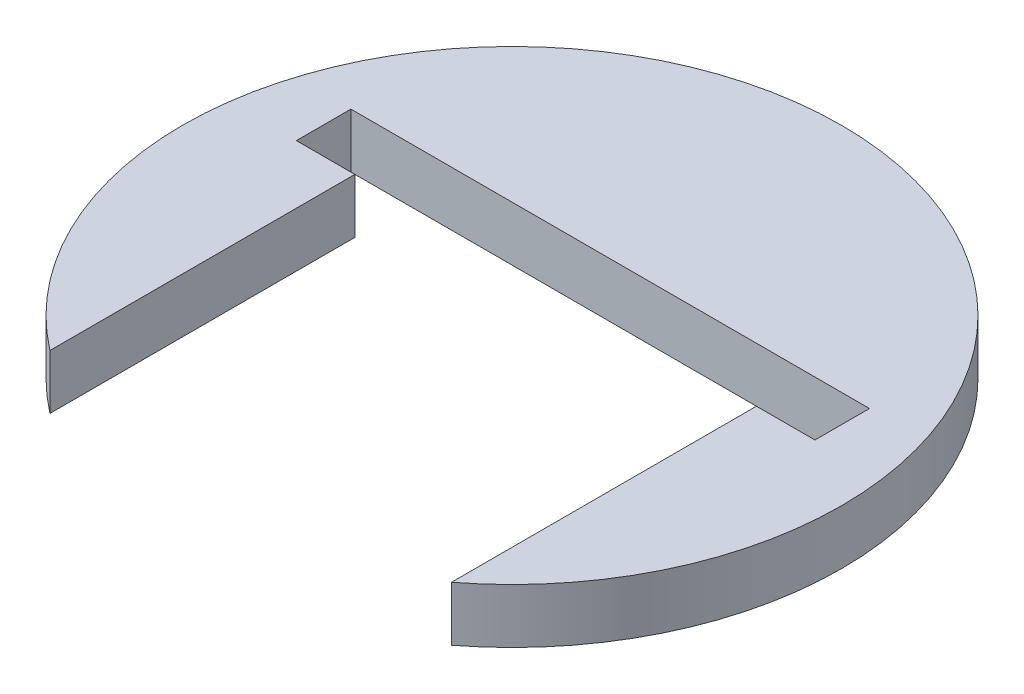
from build123d import *

# Parameters (mm, degrees)
SKETCH1_R           = 19.177
BOSS_EXTRUDE1_DEPTH = 3.175
SKETCH2_W           = 30.17980714
SKETCH2_H           = 3.175
CUT_EXTRUDE1_DEPTH  = 28.305590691
SKETCH3_W           = 23.368
SKETCH3_H           = 25.4
CUT_EXTRUDE2_DEPTH  = 28.305590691


with BuildPart() as part:
    # Sketch1 → Boss-Extrude1 (new body)
    with BuildSketch(Plane(origin=(0, 0, 0), x_dir=(1, 0, 0), z_dir=(0, 1, 0))):
        with Locations(Location((0, 0, 0), (0, 0, 270))):
            Circle(SKETCH1_R)
    extrude(amount=BOSS_EXTRUDE1_DEPTH)

    # Sketch2 → Cut-Extrude1 (cut, through all)
    with BuildSketch(Plane(origin=(0, 3.175, 0), x_dir=(1, 0, 0), z_dir=(0, 1, 0))):
        with Locations((0, 4.1275)):
            Rectangle(SKETCH2_W, SKETCH2_H)
    extrude(amount=-CUT_EXTRUDE1_DEPTH, mode=Mode.SUBTRACT)

    # Sketch3 → Cut-Extrude2 (cut, through all)
    with BuildSketch(Plane(origin=(0, 3.175, 0), x_dir=(1, 0, 0), z_dir=(0, 1, 0))):
        with Locations((0, -10.16)):
            Rectangle(SKETCH3_W, SKETCH3_H)
    extrude(amount=-CUT_EXTRUDE2_DEPTH, mode=Mode.SUBTRACT)


solid = part.part
